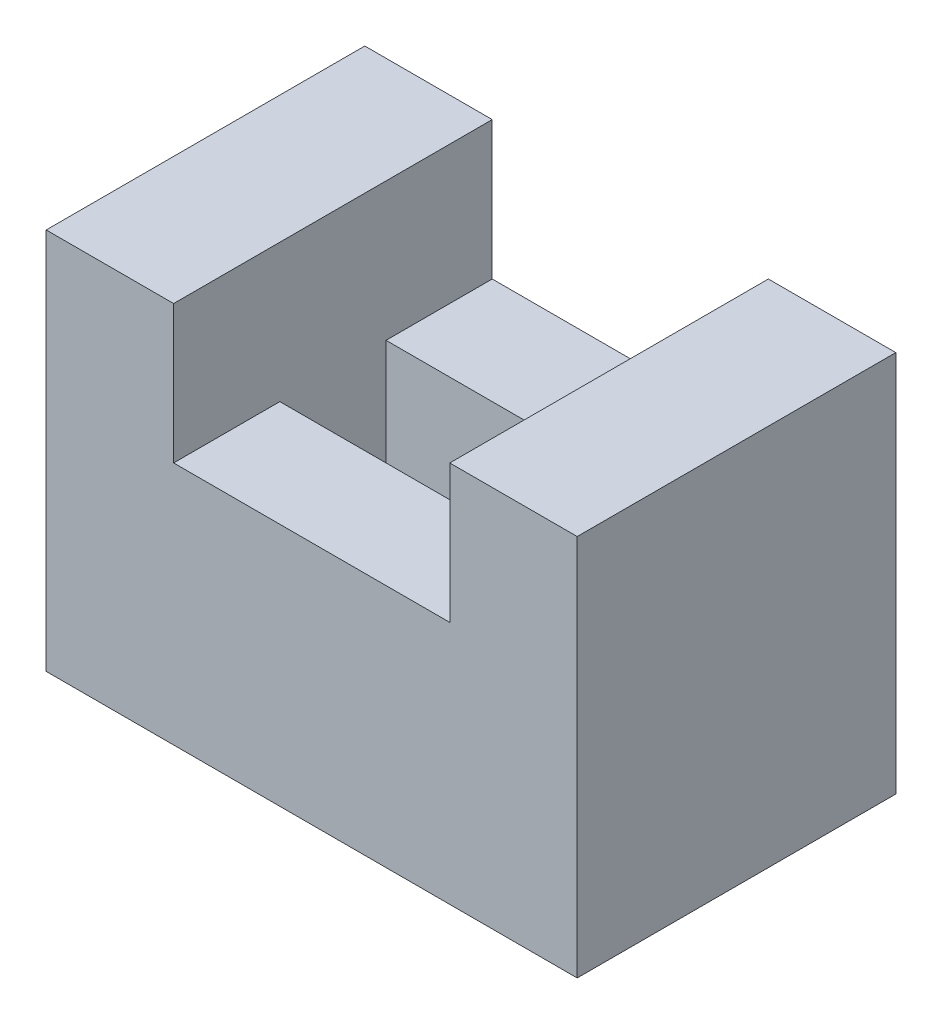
from build123d import *

# Parameters (mm, degrees)
EXTRUDE_1_DEPTH     = 60
SKETCH_2_W          = 52
SKETCH_2_H          = 20
CUT_EXTRUDE_1_DEPTH = 91.642153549


with BuildPart() as part:
    # Sketch 1 → Extrude 1 (new body)
    with BuildSketch(Plane.XY):
        Polygon((-50, -37.877873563), (50, -37.877873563), (50, 34.122126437), (26, 34.122126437), (26, 8.122126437), (-26, 8.122126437), (-26, 34.122126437), (-50, 34.122126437), align=None)
    extrude(amount=-EXTRUDE_1_DEPTH)

    # Sketch 2 → Cut-Extrude 1 (cut, through all)
    with BuildSketch(Plane(origin=(0, 8.122126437, 0), x_dir=(1, 0, 0), z_dir=(0, 1, 0))):
        with Locations((0, 30)):
            Rectangle(SKETCH_2_W, SKETCH_2_H)
    extrude(amount=-CUT_EXTRUDE_1_DEPTH, mode=Mode.SUBTRACT)


solid = part.part
